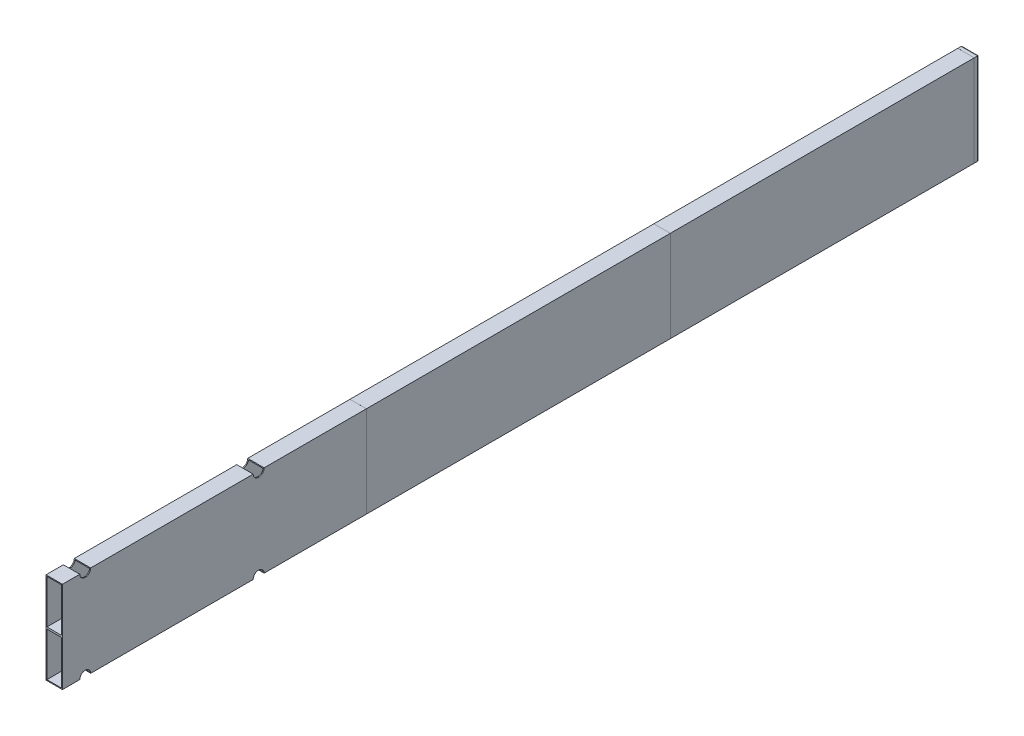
ISO-10303-21;
HEADER;
FILE_DESCRIPTION(('STEP AP214'),'2;1');
FILE_NAME('part.step','',(''),(''),'','','');
FILE_SCHEMA(('AUTOMOTIVE_DESIGN { 1 0 10303 214 1 1 1 1 }'));
ENDSEC;
DATA;
#1=APPLICATION_CONTEXT('core data for automotive mechanical design processes');
#2=APPLICATION_PROTOCOL_DEFINITION('international standard','automotive_design',2000,#1);
#3=PRODUCT_CONTEXT('',#1,'mechanical');
#4=PRODUCT('Part','Part','',(#3));
#5=PRODUCT_RELATED_PRODUCT_CATEGORY('part','',(#4));
#6=PRODUCT_DEFINITION_FORMATION('','',#4);
#7=PRODUCT_DEFINITION_CONTEXT('part definition',#1,'design');
#8=PRODUCT_DEFINITION('design','',#6,#7);
#9=PRODUCT_DEFINITION_SHAPE('','',#8);
#10=(LENGTH_UNIT() NAMED_UNIT(*) SI_UNIT(.MILLI.,.METRE.));
#11=(NAMED_UNIT(*) PLANE_ANGLE_UNIT() SI_UNIT($,.RADIAN.));
#12=(NAMED_UNIT(*) SI_UNIT($,.STERADIAN.) SOLID_ANGLE_UNIT());
#13=UNCERTAINTY_MEASURE_WITH_UNIT(LENGTH_MEASURE(1.E-05),#10,'distance_accuracy_value','');
#14=(GEOMETRIC_REPRESENTATION_CONTEXT(3) GLOBAL_UNCERTAINTY_ASSIGNED_CONTEXT((#13)) GLOBAL_UNIT_ASSIGNED_CONTEXT((#10,
#11,#12)) REPRESENTATION_CONTEXT('',''));
#15=CARTESIAN_POINT('',(0.,0.,0.));
#16=DIRECTION('',(0.,0.,1.));
#17=DIRECTION('',(1.,0.,0.));
#18=AXIS2_PLACEMENT_3D('',#15,#16,#17);
#19=CARTESIAN_POINT('',(9.01,-0.00999999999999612,-666.));
#20=DIRECTION('',(0.,0.,-1.));
#21=DIRECTION('',(-1.,0.,0.));
#22=AXIS2_PLACEMENT_3D('',#19,#20,#21);
#23=PLANE('',#22);
#24=DIRECTION('',(0.,-1.,0.));
#25=VECTOR('',#24,1.);
#26=CARTESIAN_POINT('',(9.01,100.01,-666.));
#27=LINE('',#26,#25);
#28=CARTESIAN_POINT('',(9.01,100.01,-666.));
#29=VERTEX_POINT('',#28);
#30=CARTESIAN_POINT('',(9.01,-0.00999999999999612,-666.));
#31=VERTEX_POINT('',#30);
#32=EDGE_CURVE('E406',#29,#31,#27,.T.);
#33=ORIENTED_EDGE('',*,*,#32,.T.);
#34=DIRECTION('',(-1.,0.,0.));
#35=VECTOR('',#34,1.);
#36=CARTESIAN_POINT('',(9.01,-0.00999999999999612,-666.));
#37=LINE('',#36,#35);
#38=CARTESIAN_POINT('',(-9.01,-0.00999999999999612,-666.));
#39=VERTEX_POINT('',#38);
#40=EDGE_CURVE('E409',#31,#39,#37,.T.);
#41=ORIENTED_EDGE('',*,*,#40,.T.);
#42=DIRECTION('',(0.,1.,0.));
#43=VECTOR('',#42,1.);
#44=CARTESIAN_POINT('',(-9.01,100.01,-666.));
#45=LINE('',#44,#43);
#46=CARTESIAN_POINT('',(-9.01,100.01,-666.));
#47=VERTEX_POINT('',#46);
#48=EDGE_CURVE('E411',#39,#47,#45,.T.);
#49=ORIENTED_EDGE('',*,*,#48,.T.);
#50=DIRECTION('',(1.,0.,0.));
#51=VECTOR('',#50,1.);
#52=CARTESIAN_POINT('',(9.01,100.01,-666.));
#53=LINE('',#52,#51);
#54=EDGE_CURVE('E413',#47,#29,#53,.T.);
#55=ORIENTED_EDGE('',*,*,#54,.T.);
#56=EDGE_LOOP('',(#33,#41,#49,#55));
#57=FACE_BOUND('',#56,.T.);
#58=DIRECTION('',(-1.,0.,0.));
#59=VECTOR('',#58,1.);
#60=CARTESIAN_POINT('',(9.,0.,-666.));
#61=LINE('',#60,#59);
#62=CARTESIAN_POINT('',(9.,0.,-666.));
#63=VERTEX_POINT('',#62);
#64=CARTESIAN_POINT('',(-9.,0.,-666.));
#65=VERTEX_POINT('',#64);
#66=EDGE_CURVE('E368',#63,#65,#61,.T.);
#67=ORIENTED_EDGE('',*,*,#66,.F.);
#68=DIRECTION('',(0.,-1.,0.));
#69=VECTOR('',#68,1.);
#70=CARTESIAN_POINT('',(9.,100.,-666.));
#71=LINE('',#70,#69);
#72=CARTESIAN_POINT('',(9.,100.,-666.));
#73=VERTEX_POINT('',#72);
#74=EDGE_CURVE('E365',#73,#63,#71,.T.);
#75=ORIENTED_EDGE('',*,*,#74,.F.);
#76=DIRECTION('',(1.,0.,0.));
#77=VECTOR('',#76,1.);
#78=CARTESIAN_POINT('',(9.,100.,-666.));
#79=LINE('',#78,#77);
#80=CARTESIAN_POINT('',(-9.,100.,-666.));
#81=VERTEX_POINT('',#80);
#82=EDGE_CURVE('E373',#81,#73,#79,.T.);
#83=ORIENTED_EDGE('',*,*,#82,.F.);
#84=DIRECTION('',(0.,1.,0.));
#85=VECTOR('',#84,1.);
#86=CARTESIAN_POINT('',(-9.,100.,-666.));
#87=LINE('',#86,#85);
#88=EDGE_CURVE('E370',#65,#81,#87,.T.);
#89=ORIENTED_EDGE('',*,*,#88,.F.);
#90=EDGE_LOOP('',(#67,#75,#83,#89));
#91=FACE_BOUND('',#90,.T.);
#92=ADVANCED_FACE('F36',(#57,#91),#23,.T.);
#93=CARTESIAN_POINT('',(-9.,0.,-333.));
#94=DIRECTION('',(0.,-1.,0.));
#95=DIRECTION('',(0.,0.,-1.));
#96=AXIS2_PLACEMENT_3D('',#93,#94,#95);
#97=PLANE('',#96);
#98=DIRECTION('',(1.,0.,0.));
#99=VECTOR('',#98,1.);
#100=CARTESIAN_POINT('',(-9.00000000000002,0.,-221.));
#101=LINE('',#100,#99);
#102=CARTESIAN_POINT('',(-9.00000000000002,0.,-221.));
#103=VERTEX_POINT('',#102);
#104=CARTESIAN_POINT('',(9.,0.,-221.));
#105=VERTEX_POINT('',#104);
#106=EDGE_CURVE('E443',#103,#105,#101,.T.);
#107=ORIENTED_EDGE('',*,*,#106,.F.);
#108=DIRECTION('',(0.,0.,1.));
#109=VECTOR('',#108,1.);
#110=CARTESIAN_POINT('',(-9.,0.,-333.));
#111=LINE('',#110,#109);
#112=CARTESIAN_POINT('',(-9.,0.,-333.));
#113=VERTEX_POINT('',#112);
#114=EDGE_CURVE('E593',#113,#103,#111,.T.);
#115=ORIENTED_EDGE('',*,*,#114,.F.);
#116=DIRECTION('',(1.,0.,0.));
#117=VECTOR('',#116,1.);
#118=CARTESIAN_POINT('',(-9.,0.,-333.));
#119=LINE('',#118,#117);
#120=CARTESIAN_POINT('',(9.,0.,-333.));
#121=VERTEX_POINT('',#120);
#122=EDGE_CURVE('E567',#113,#121,#119,.T.);
#123=ORIENTED_EDGE('',*,*,#122,.T.);
#124=DIRECTION('',(0.,0.,1.));
#125=VECTOR('',#124,1.);
#126=CARTESIAN_POINT('',(9.,0.,-333.));
#127=LINE('',#126,#125);
#128=EDGE_CURVE('E588',#121,#105,#127,.T.);
#129=ORIENTED_EDGE('',*,*,#128,.T.);
#130=EDGE_LOOP('',(#107,#115,#123,#129));
#131=FACE_BOUND('',#130,.T.);
#132=ADVANCED_FACE('F662',(#131),#97,.T.);
#133=CARTESIAN_POINT('',(-8.,1.,-333.));
#134=DIRECTION('',(0.,-1.,0.));
#135=DIRECTION('',(0.,0.,-1.));
#136=AXIS2_PLACEMENT_3D('',#133,#134,#135);
#137=PLANE('',#136);
#138=DIRECTION('',(0.,0.,1.));
#139=VECTOR('',#138,1.);
#140=CARTESIAN_POINT('',(-8.,1.,-333.));
#141=LINE('',#140,#139);
#142=CARTESIAN_POINT('',(-8.,1.,-999.));
#143=VERTEX_POINT('',#142);
#144=CARTESIAN_POINT('',(-8.,1.,-220.9160797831));
#145=VERTEX_POINT('',#144);
#146=EDGE_CURVE('E522',#143,#145,#141,.T.);
#147=ORIENTED_EDGE('',*,*,#146,.T.);
#148=DIRECTION('',(1.,0.,0.));
#149=VECTOR('',#148,1.);
#150=CARTESIAN_POINT('',(-9.00000000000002,1.,-220.9160797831));
#151=LINE('',#150,#149);
#152=CARTESIAN_POINT('',(8.,1.,-220.9160797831));
#153=VERTEX_POINT('',#152);
#154=EDGE_CURVE('E435',#145,#153,#151,.T.);
#155=ORIENTED_EDGE('',*,*,#154,.T.);
#156=DIRECTION('',(0.,0.,1.));
#157=VECTOR('',#156,1.);
#158=CARTESIAN_POINT('',(8.,1.,-333.));
#159=LINE('',#158,#157);
#160=CARTESIAN_POINT('',(8.,1.,-999.));
#161=VERTEX_POINT('',#160);
#162=EDGE_CURVE('E517',#161,#153,#159,.T.);
#163=ORIENTED_EDGE('',*,*,#162,.F.);
#164=DIRECTION('',(-1.,0.,0.));
#165=VECTOR('',#164,1.);
#166=CARTESIAN_POINT('',(8.,1.,-999.));
#167=LINE('',#166,#165);
#168=EDGE_CURVE('E344',#161,#143,#167,.T.);
#169=ORIENTED_EDGE('',*,*,#168,.T.);
#170=EDGE_LOOP('',(#147,#155,#163,#169));
#171=FACE_BOUND('',#170,.T.);
#172=ADVANCED_FACE('F668',(#171),#137,.F.);
#173=DIRECTION('',(1.,0.,0.));
#174=VECTOR('',#173,1.);
#175=CARTESIAN_POINT('',(-9.00000000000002,0.,-209.));
#176=LINE('',#175,#174);
#177=CARTESIAN_POINT('',(9.,0.,-209.));
#178=VERTEX_POINT('',#177);
#179=CARTESIAN_POINT('',(-9.00000000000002,0.,-209.));
#180=VERTEX_POINT('',#179);
#181=EDGE_CURVE('E441',#178,#180,#176,.F.);
#182=ORIENTED_EDGE('',*,*,#181,.F.);
#183=CARTESIAN_POINT('',(9.,0.,-31.));
#184=VERTEX_POINT('',#183);
#185=EDGE_CURVE('E591',#178,#184,#127,.T.);
#186=ORIENTED_EDGE('',*,*,#185,.T.);
#187=DIRECTION('',(1.,0.,0.));
#188=VECTOR('',#187,1.);
#189=CARTESIAN_POINT('',(-9.00000000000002,0.,-31.));
#190=LINE('',#189,#188);
#191=CARTESIAN_POINT('',(-9.00000000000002,0.,-31.));
#192=VERTEX_POINT('',#191);
#193=EDGE_CURVE('E458',#192,#184,#190,.T.);
#194=ORIENTED_EDGE('',*,*,#193,.F.);
#195=EDGE_CURVE('E596',#180,#192,#111,.T.);
#196=ORIENTED_EDGE('',*,*,#195,.F.);
#197=EDGE_LOOP('',(#182,#186,#194,#196));
#198=FACE_BOUND('',#197,.T.);
#199=ADVANCED_FACE('F670',(#198),#97,.T.);
#200=CARTESIAN_POINT('',(8.,1.,-209.0839202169));
#201=VERTEX_POINT('',#200);
#202=CARTESIAN_POINT('',(8.,1.,-30.9160797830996));
#203=VERTEX_POINT('',#202);
#204=EDGE_CURVE('E520',#201,#203,#159,.T.);
#205=ORIENTED_EDGE('',*,*,#204,.F.);
#206=DIRECTION('',(1.,0.,0.));
#207=VECTOR('',#206,1.);
#208=CARTESIAN_POINT('',(-9.00000000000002,1.,-209.0839202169));
#209=LINE('',#208,#207);
#210=CARTESIAN_POINT('',(-8.,1.,-209.0839202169));
#211=VERTEX_POINT('',#210);
#212=EDGE_CURVE('E432',#201,#211,#209,.F.);
#213=ORIENTED_EDGE('',*,*,#212,.T.);
#214=CARTESIAN_POINT('',(-8.,1.,-30.9160797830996));
#215=VERTEX_POINT('',#214);
#216=EDGE_CURVE('E525',#211,#215,#141,.T.);
#217=ORIENTED_EDGE('',*,*,#216,.T.);
#218=DIRECTION('',(1.,0.,0.));
#219=VECTOR('',#218,1.);
#220=CARTESIAN_POINT('',(-9.00000000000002,1.,-30.9160797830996));
#221=LINE('',#220,#219);
#222=EDGE_CURVE('E605',#215,#203,#221,.T.);
#223=ORIENTED_EDGE('',*,*,#222,.T.);
#224=EDGE_LOOP('',(#205,#213,#217,#223));
#225=FACE_BOUND('',#224,.T.);
#226=ADVANCED_FACE('F723',(#225),#137,.F.);
#227=CARTESIAN_POINT('',(-9.00000000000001,100.,-333.));
#228=DIRECTION('',(0.,1.,0.));
#229=DIRECTION('',(0.,0.,1.));
#230=AXIS2_PLACEMENT_3D('',#227,#228,#229);
#231=PLANE('',#230);
#232=DIRECTION('',(1.,0.,0.));
#233=VECTOR('',#232,1.);
#234=CARTESIAN_POINT('',(-9.00000000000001,100.,-209.));
#235=LINE('',#234,#233);
#236=CARTESIAN_POINT('',(-9.00000000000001,100.,-209.));
#237=VERTEX_POINT('',#236);
#238=CARTESIAN_POINT('',(9.00000000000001,100.,-209.));
#239=VERTEX_POINT('',#238);
#240=EDGE_CURVE('E477',#237,#239,#235,.T.);
#241=ORIENTED_EDGE('',*,*,#240,.F.);
#242=DIRECTION('',(0.,0.,1.));
#243=VECTOR('',#242,1.);
#244=CARTESIAN_POINT('',(-9.00000000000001,100.,-333.));
#245=LINE('',#244,#243);
#246=CARTESIAN_POINT('',(-9.00000000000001,100.,-31.));
#247=VERTEX_POINT('',#246);
#248=EDGE_CURVE('E581',#237,#247,#245,.T.);
#249=ORIENTED_EDGE('',*,*,#248,.T.);
#250=DIRECTION('',(1.,0.,0.));
#251=VECTOR('',#250,1.);
#252=CARTESIAN_POINT('',(-9.00000000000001,100.,-31.));
#253=LINE('',#252,#251);
#254=CARTESIAN_POINT('',(9.00000000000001,100.,-31.));
#255=VERTEX_POINT('',#254);
#256=EDGE_CURVE('E494',#255,#247,#253,.F.);
#257=ORIENTED_EDGE('',*,*,#256,.F.);
#258=DIRECTION('',(0.,0.,1.));
#259=VECTOR('',#258,1.);
#260=CARTESIAN_POINT('',(9.00000000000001,100.,-333.));
#261=LINE('',#260,#259);
#262=EDGE_CURVE('E586',#239,#255,#261,.T.);
#263=ORIENTED_EDGE('',*,*,#262,.F.);
#264=EDGE_LOOP('',(#241,#249,#257,#263));
#265=FACE_BOUND('',#264,.T.);
#266=ADVANCED_FACE('F754',(#265),#231,.T.);
#267=CARTESIAN_POINT('',(-8.,99.,-333.));
#268=DIRECTION('',(0.,1.,0.));
#269=DIRECTION('',(0.,0.,1.));
#270=AXIS2_PLACEMENT_3D('',#267,#268,#269);
#271=PLANE('',#270);
#272=DIRECTION('',(0.,0.,1.));
#273=VECTOR('',#272,1.);
#274=CARTESIAN_POINT('',(-8.,99.,-333.));
#275=LINE('',#274,#273);
#276=CARTESIAN_POINT('',(-8.,99.,-209.0839202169));
#277=VERTEX_POINT('',#276);
#278=CARTESIAN_POINT('',(-8.,99.,-30.9160797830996));
#279=VERTEX_POINT('',#278);
#280=EDGE_CURVE('E541',#277,#279,#275,.T.);
#281=ORIENTED_EDGE('',*,*,#280,.F.);
#282=DIRECTION('',(1.,0.,0.));
#283=VECTOR('',#282,1.);
#284=CARTESIAN_POINT('',(-9.00000000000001,99.,-209.0839202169));
#285=LINE('',#284,#283);
#286=CARTESIAN_POINT('',(8.,99.,-209.0839202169));
#287=VERTEX_POINT('',#286);
#288=EDGE_CURVE('E469',#277,#287,#285,.T.);
#289=ORIENTED_EDGE('',*,*,#288,.T.);
#290=DIRECTION('',(0.,0.,1.));
#291=VECTOR('',#290,1.);
#292=CARTESIAN_POINT('',(8.,99.,-333.));
#293=LINE('',#292,#291);
#294=CARTESIAN_POINT('',(8.,99.,-30.9160797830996));
#295=VERTEX_POINT('',#294);
#296=EDGE_CURVE('E546',#287,#295,#293,.T.);
#297=ORIENTED_EDGE('',*,*,#296,.T.);
#298=DIRECTION('',(1.,0.,0.));
#299=VECTOR('',#298,1.);
#300=CARTESIAN_POINT('',(-9.00000000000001,99.,-30.9160797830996));
#301=LINE('',#300,#299);
#302=EDGE_CURVE('E485',#295,#279,#301,.F.);
#303=ORIENTED_EDGE('',*,*,#302,.T.);
#304=EDGE_LOOP('',(#281,#289,#297,#303));
#305=FACE_BOUND('',#304,.T.);
#306=ADVANCED_FACE('F734',(#305),#271,.F.);
#307=DIRECTION('',(1.,0.,0.));
#308=VECTOR('',#307,1.);
#309=CARTESIAN_POINT('',(-9.00000000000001,100.,-19.));
#310=LINE('',#309,#308);
#311=CARTESIAN_POINT('',(-9.00000000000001,100.,-19.));
#312=VERTEX_POINT('',#311);
#313=CARTESIAN_POINT('',(9.00000000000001,100.,-19.));
#314=VERTEX_POINT('',#313);
#315=EDGE_CURVE('E497',#312,#314,#310,.T.);
#316=ORIENTED_EDGE('',*,*,#315,.F.);
#317=CARTESIAN_POINT('',(-9.00000000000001,100.,0.));
#318=VERTEX_POINT('',#317);
#319=EDGE_CURVE('E582',#312,#318,#245,.T.);
#320=ORIENTED_EDGE('',*,*,#319,.T.);
#321=DIRECTION('',(-1.,0.,0.));
#322=VECTOR('',#321,1.);
#323=CARTESIAN_POINT('',(-9.00000000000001,100.,0.));
#324=LINE('',#323,#322);
#325=CARTESIAN_POINT('',(9.00000000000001,100.,0.));
#326=VERTEX_POINT('',#325);
#327=EDGE_CURVE('E561',#326,#318,#324,.T.);
#328=ORIENTED_EDGE('',*,*,#327,.F.);
#329=EDGE_CURVE('E587',#314,#326,#261,.T.);
#330=ORIENTED_EDGE('',*,*,#329,.F.);
#331=EDGE_LOOP('',(#316,#320,#328,#330));
#332=FACE_BOUND('',#331,.T.);
#333=ADVANCED_FACE('F755',(#332),#231,.T.);
#334=CARTESIAN_POINT('',(-8.,99.,-19.0839202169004));
#335=VERTEX_POINT('',#334);
#336=CARTESIAN_POINT('',(-8.,99.,0.));
#337=VERTEX_POINT('',#336);
#338=EDGE_CURVE('E542',#335,#337,#275,.T.);
#339=ORIENTED_EDGE('',*,*,#338,.F.);
#340=DIRECTION('',(1.,0.,0.));
#341=VECTOR('',#340,1.);
#342=CARTESIAN_POINT('',(-9.00000000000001,99.,-19.0839202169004));
#343=LINE('',#342,#341);
#344=CARTESIAN_POINT('',(8.,99.,-19.0839202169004));
#345=VERTEX_POINT('',#344);
#346=EDGE_CURVE('E488',#335,#345,#343,.T.);
#347=ORIENTED_EDGE('',*,*,#346,.T.);
#348=CARTESIAN_POINT('',(8.,99.,0.));
#349=VERTEX_POINT('',#348);
#350=EDGE_CURVE('E547',#345,#349,#293,.T.);
#351=ORIENTED_EDGE('',*,*,#350,.T.);
#352=DIRECTION('',(-1.,0.,0.));
#353=VECTOR('',#352,1.);
#354=CARTESIAN_POINT('',(-8.,99.,0.));
#355=LINE('',#354,#353);
#356=EDGE_CURVE('E533',#349,#337,#355,.T.);
#357=ORIENTED_EDGE('',*,*,#356,.T.);
#358=EDGE_LOOP('',(#339,#347,#351,#357));
#359=FACE_BOUND('',#358,.T.);
#360=ADVANCED_FACE('F735',(#359),#271,.F.);
#361=CARTESIAN_POINT('',(-9.00000000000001,100.,-333.));
#362=DIRECTION('',(-1.,0.,0.));
#363=DIRECTION('',(0.,-1.,0.));
#364=AXIS2_PLACEMENT_3D('',#361,#362,#363);
#365=PLANE('',#364);
#366=CARTESIAN_POINT('',(-9.00000000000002,0.,-215.));
#367=DIRECTION('',(1.,0.,0.));
#368=DIRECTION('',(0.,1.,0.));
#369=AXIS2_PLACEMENT_3D('',#366,#367,#368);
#370=CIRCLE('',#369,6.00000000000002);
#371=EDGE_CURVE('E429',#103,#180,#370,.T.);
#372=ORIENTED_EDGE('',*,*,#371,.T.);
#373=ORIENTED_EDGE('',*,*,#195,.T.);
#374=CARTESIAN_POINT('',(-9.00000000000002,0.,-25.));
#375=DIRECTION('',(1.,0.,0.));
#376=DIRECTION('',(0.,1.,0.));
#377=AXIS2_PLACEMENT_3D('',#374,#375,#376);
#378=CIRCLE('',#377,6.);
#379=CARTESIAN_POINT('',(-9.00000000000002,0.,-19.));
#380=VERTEX_POINT('',#379);
#381=EDGE_CURVE('E447',#192,#380,#378,.T.);
#382=ORIENTED_EDGE('',*,*,#381,.T.);
#383=CARTESIAN_POINT('',(-9.,0.,0.));
#384=VERTEX_POINT('',#383);
#385=EDGE_CURVE('E576',#380,#384,#111,.T.);
#386=ORIENTED_EDGE('',*,*,#385,.T.);
#387=DIRECTION('',(0.,-1.,0.));
#388=VECTOR('',#387,1.);
#389=CARTESIAN_POINT('',(-9.00000000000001,100.,0.));
#390=LINE('',#389,#388);
#391=EDGE_CURVE('E540',#318,#384,#390,.T.);
#392=ORIENTED_EDGE('',*,*,#391,.F.);
#393=ORIENTED_EDGE('',*,*,#319,.F.);
#394=CARTESIAN_POINT('',(-9.00000000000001,100.,-25.));
#395=DIRECTION('',(1.,0.,0.));
#396=DIRECTION('',(0.,1.,0.));
#397=AXIS2_PLACEMENT_3D('',#394,#395,#396);
#398=CIRCLE('',#397,6.00000000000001);
#399=EDGE_CURVE('E482',#312,#247,#398,.T.);
#400=ORIENTED_EDGE('',*,*,#399,.T.);
#401=ORIENTED_EDGE('',*,*,#248,.F.);
#402=CARTESIAN_POINT('',(-9.00000000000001,100.,-215.));
#403=DIRECTION('',(1.,0.,0.));
#404=DIRECTION('',(0.,1.,0.));
#405=AXIS2_PLACEMENT_3D('',#402,#403,#404);
#406=CIRCLE('',#405,6.00000000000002);
#407=CARTESIAN_POINT('',(-9.00000000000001,100.,-221.));
#408=VERTEX_POINT('',#407);
#409=EDGE_CURVE('E463',#237,#408,#406,.T.);
#410=ORIENTED_EDGE('',*,*,#409,.T.);
#411=CARTESIAN_POINT('',(-9.00000000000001,100.,-333.));
#412=VERTEX_POINT('',#411);
#413=EDGE_CURVE('E577',#412,#408,#245,.T.);
#414=ORIENTED_EDGE('',*,*,#413,.F.);
#415=DIRECTION('',(0.,-1.,0.));
#416=VECTOR('',#415,1.);
#417=CARTESIAN_POINT('',(-9.00000000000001,100.,-333.));
#418=LINE('',#417,#416);
#419=EDGE_CURVE('E564',#412,#113,#418,.T.);
#420=ORIENTED_EDGE('',*,*,#419,.T.);
#421=ORIENTED_EDGE('',*,*,#114,.T.);
#422=EDGE_LOOP('',(#372,#373,#382,#386,#392,#393,#400,#401,#410,#414,#420,#421));
#423=FACE_BOUND('',#422,.T.);
#424=ADVANCED_FACE('F38',(#423),#365,.T.);
#425=DIRECTION('',(1.,0.,0.));
#426=VECTOR('',#425,1.);
#427=CARTESIAN_POINT('',(-9.00000000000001,100.,-221.));
#428=LINE('',#427,#426);
#429=CARTESIAN_POINT('',(9.00000000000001,100.,-221.));
#430=VERTEX_POINT('',#429);
#431=EDGE_CURVE('E475',#430,#408,#428,.F.);
#432=ORIENTED_EDGE('',*,*,#431,.F.);
#433=CARTESIAN_POINT('',(9.00000000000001,100.,-333.));
#434=VERTEX_POINT('',#433);
#435=EDGE_CURVE('E583',#434,#430,#261,.T.);
#436=ORIENTED_EDGE('',*,*,#435,.F.);
#437=DIRECTION('',(-1.,0.,0.));
#438=VECTOR('',#437,1.);
#439=CARTESIAN_POINT('',(-9.00000000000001,100.,-333.));
#440=LINE('',#439,#438);
#441=EDGE_CURVE('E573',#434,#412,#440,.T.);
#442=ORIENTED_EDGE('',*,*,#441,.T.);
#443=ORIENTED_EDGE('',*,*,#413,.T.);
#444=EDGE_LOOP('',(#432,#436,#442,#443));
#445=FACE_BOUND('',#444,.T.);
#446=ADVANCED_FACE('F749',(#445),#231,.T.);
#447=CARTESIAN_POINT('',(9.00000000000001,100.,-333.));
#448=DIRECTION('',(1.,0.,0.));
#449=DIRECTION('',(0.,1.,0.));
#450=AXIS2_PLACEMENT_3D('',#447,#448,#449);
#451=PLANE('',#450);
#452=CARTESIAN_POINT('',(9.,0.,-215.));
#453=DIRECTION('',(1.,0.,0.));
#454=DIRECTION('',(0.,1.,0.));
#455=AXIS2_PLACEMENT_3D('',#452,#453,#454);
#456=CIRCLE('',#455,6.00000000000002);
#457=EDGE_CURVE('E427',#105,#178,#456,.T.);
#458=ORIENTED_EDGE('',*,*,#457,.F.);
#459=ORIENTED_EDGE('',*,*,#128,.F.);
#460=DIRECTION('',(0.,1.,0.));
#461=VECTOR('',#460,1.);
#462=CARTESIAN_POINT('',(9.00000000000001,100.,-333.));
#463=LINE('',#462,#461);
#464=EDGE_CURVE('E570',#121,#434,#463,.T.);
#465=ORIENTED_EDGE('',*,*,#464,.T.);
#466=ORIENTED_EDGE('',*,*,#435,.T.);
#467=CARTESIAN_POINT('',(9.00000000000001,100.,-215.));
#468=DIRECTION('',(1.,0.,0.));
#469=DIRECTION('',(0.,1.,0.));
#470=AXIS2_PLACEMENT_3D('',#467,#468,#469);
#471=CIRCLE('',#470,6.00000000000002);
#472=EDGE_CURVE('E461',#239,#430,#471,.T.);
#473=ORIENTED_EDGE('',*,*,#472,.F.);
#474=ORIENTED_EDGE('',*,*,#262,.T.);
#475=CARTESIAN_POINT('',(9.00000000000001,100.,-25.));
#476=DIRECTION('',(1.,0.,0.));
#477=DIRECTION('',(0.,1.,0.));
#478=AXIS2_PLACEMENT_3D('',#475,#476,#477);
#479=CIRCLE('',#478,6.00000000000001);
#480=EDGE_CURVE('E479',#314,#255,#479,.T.);
#481=ORIENTED_EDGE('',*,*,#480,.F.);
#482=ORIENTED_EDGE('',*,*,#329,.T.);
#483=DIRECTION('',(0.,1.,0.));
#484=VECTOR('',#483,1.);
#485=CARTESIAN_POINT('',(9.00000000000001,100.,0.));
#486=LINE('',#485,#484);
#487=CARTESIAN_POINT('',(9.,0.,0.));
#488=VERTEX_POINT('',#487);
#489=EDGE_CURVE('E558',#488,#326,#486,.T.);
#490=ORIENTED_EDGE('',*,*,#489,.F.);
#491=CARTESIAN_POINT('',(9.,0.,-19.));
#492=VERTEX_POINT('',#491);
#493=EDGE_CURVE('E592',#492,#488,#127,.T.);
#494=ORIENTED_EDGE('',*,*,#493,.F.);
#495=CARTESIAN_POINT('',(9.,0.,-25.));
#496=DIRECTION('',(1.,0.,0.));
#497=DIRECTION('',(0.,1.,0.));
#498=AXIS2_PLACEMENT_3D('',#495,#496,#497);
#499=CIRCLE('',#498,6.);
#500=EDGE_CURVE('E445',#184,#492,#499,.T.);
#501=ORIENTED_EDGE('',*,*,#500,.F.);
#502=ORIENTED_EDGE('',*,*,#185,.F.);
#503=EDGE_LOOP('',(#458,#459,#465,#466,#473,#474,#481,#482,#490,#494,#501,#502));
#504=FACE_BOUND('',#503,.T.);
#505=ADVANCED_FACE('F752',(#504),#451,.T.);
#506=DIRECTION('',(1.,0.,0.));
#507=VECTOR('',#506,1.);
#508=CARTESIAN_POINT('',(-9.00000000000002,0.,-19.));
#509=LINE('',#508,#507);
#510=EDGE_CURVE('E456',#492,#380,#509,.F.);
#511=ORIENTED_EDGE('',*,*,#510,.F.);
#512=ORIENTED_EDGE('',*,*,#493,.T.);
#513=DIRECTION('',(1.,0.,0.));
#514=VECTOR('',#513,1.);
#515=CARTESIAN_POINT('',(-9.,0.,0.));
#516=LINE('',#515,#514);
#517=EDGE_CURVE('E555',#384,#488,#516,.T.);
#518=ORIENTED_EDGE('',*,*,#517,.F.);
#519=ORIENTED_EDGE('',*,*,#385,.F.);
#520=EDGE_LOOP('',(#511,#512,#518,#519));
#521=FACE_BOUND('',#520,.T.);
#522=ADVANCED_FACE('F671',(#521),#97,.T.);
#523=CARTESIAN_POINT('',(-9.,0.,0.));
#524=DIRECTION('',(0.,0.,1.));
#525=DIRECTION('',(1.,0.,0.));
#526=AXIS2_PLACEMENT_3D('',#523,#524,#525);
#527=PLANE('',#526);
#528=DIRECTION('',(0.,-1.,0.));
#529=VECTOR('',#528,1.);
#530=CARTESIAN_POINT('',(-8.,1.,0.));
#531=LINE('',#530,#529);
#532=CARTESIAN_POINT('',(-8.00000000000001,49.,0.));
#533=VERTEX_POINT('',#532);
#534=CARTESIAN_POINT('',(-8.,1.,0.));
#535=VERTEX_POINT('',#534);
#536=EDGE_CURVE('E499',#533,#535,#531,.T.);
#537=ORIENTED_EDGE('',*,*,#536,.F.);
#538=DIRECTION('',(-1.,0.,0.));
#539=VECTOR('',#538,1.);
#540=CARTESIAN_POINT('',(-8.00000000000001,49.,0.));
#541=LINE('',#540,#539);
#542=CARTESIAN_POINT('',(8.00000000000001,49.,0.));
#543=VERTEX_POINT('',#542);
#544=EDGE_CURVE('E508',#543,#533,#541,.T.);
#545=ORIENTED_EDGE('',*,*,#544,.F.);
#546=DIRECTION('',(0.,1.,0.));
#547=VECTOR('',#546,1.);
#548=CARTESIAN_POINT('',(8.,1.,0.));
#549=LINE('',#548,#547);
#550=CARTESIAN_POINT('',(8.,1.,0.));
#551=VERTEX_POINT('',#550);
#552=EDGE_CURVE('E505',#551,#543,#549,.T.);
#553=ORIENTED_EDGE('',*,*,#552,.F.);
#554=DIRECTION('',(1.,0.,0.));
#555=VECTOR('',#554,1.);
#556=CARTESIAN_POINT('',(-8.,1.,0.));
#557=LINE('',#556,#555);
#558=EDGE_CURVE('E502',#535,#551,#557,.T.);
#559=ORIENTED_EDGE('',*,*,#558,.F.);
#560=EDGE_LOOP('',(#537,#545,#553,#559));
#561=FACE_BOUND('',#560,.T.);
#562=DIRECTION('',(0.,-1.,0.));
#563=VECTOR('',#562,1.);
#564=CARTESIAN_POINT('',(-8.,99.,0.));
#565=LINE('',#564,#563);
#566=CARTESIAN_POINT('',(-8.00000000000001,51.,0.));
#567=VERTEX_POINT('',#566);
#568=EDGE_CURVE('E514',#337,#567,#565,.T.);
#569=ORIENTED_EDGE('',*,*,#568,.F.);
#570=ORIENTED_EDGE('',*,*,#356,.F.);
#571=DIRECTION('',(0.,1.,0.));
#572=VECTOR('',#571,1.);
#573=CARTESIAN_POINT('',(8.,99.,0.));
#574=LINE('',#573,#572);
#575=CARTESIAN_POINT('',(8.00000000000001,51.,0.));
#576=VERTEX_POINT('',#575);
#577=EDGE_CURVE('E530',#576,#349,#574,.T.);
#578=ORIENTED_EDGE('',*,*,#577,.F.);
#579=DIRECTION('',(1.,0.,0.));
#580=VECTOR('',#579,1.);
#581=CARTESIAN_POINT('',(-8.00000000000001,51.,0.));
#582=LINE('',#581,#580);
#583=EDGE_CURVE('E527',#567,#576,#582,.T.);
#584=ORIENTED_EDGE('',*,*,#583,.F.);
#585=EDGE_LOOP('',(#569,#570,#578,#584));
#586=FACE_BOUND('',#585,.T.);
#587=ORIENTED_EDGE('',*,*,#391,.T.);
#588=ORIENTED_EDGE('',*,*,#517,.T.);
#589=ORIENTED_EDGE('',*,*,#489,.T.);
#590=ORIENTED_EDGE('',*,*,#327,.T.);
#591=EDGE_LOOP('',(#587,#588,#589,#590));
#592=FACE_BOUND('',#591,.T.);
#593=ADVANCED_FACE('F744',(#561,#586,#592),#527,.T.);
#594=CARTESIAN_POINT('',(-8.,99.,-333.));
#595=DIRECTION('',(-1.,0.,0.));
#596=DIRECTION('',(0.,-1.,0.));
#597=AXIS2_PLACEMENT_3D('',#594,#595,#596);
#598=PLANE('',#597);
#599=CARTESIAN_POINT('',(-8.,99.,-999.));
#600=VERTEX_POINT('',#599);
#601=CARTESIAN_POINT('',(-8.,99.,-220.9160797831));
#602=VERTEX_POINT('',#601);
#603=EDGE_CURVE('E537',#600,#602,#275,.T.);
#604=ORIENTED_EDGE('',*,*,#603,.T.);
#605=CARTESIAN_POINT('',(-8.,100.,-215.));
#606=DIRECTION('',(-1.,0.,0.));
#607=DIRECTION('',(0.,-1.,0.));
#608=AXIS2_PLACEMENT_3D('',#605,#606,#607);
#609=CIRCLE('',#608,6.00000000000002);
#610=EDGE_CURVE('E472',#602,#277,#609,.T.);
#611=ORIENTED_EDGE('',*,*,#610,.T.);
#612=ORIENTED_EDGE('',*,*,#280,.T.);
#613=CARTESIAN_POINT('',(-8.,100.,-25.));
#614=DIRECTION('',(-1.,0.,0.));
#615=DIRECTION('',(0.,-1.,0.));
#616=AXIS2_PLACEMENT_3D('',#613,#614,#615);
#617=CIRCLE('',#616,6.00000000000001);
#618=EDGE_CURVE('E491',#279,#335,#617,.T.);
#619=ORIENTED_EDGE('',*,*,#618,.T.);
#620=ORIENTED_EDGE('',*,*,#338,.T.);
#621=ORIENTED_EDGE('',*,*,#568,.T.);
#622=DIRECTION('',(0.,0.,1.));
#623=VECTOR('',#622,1.);
#624=CARTESIAN_POINT('',(-8.00000000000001,51.,-333.));
#625=LINE('',#624,#623);
#626=CARTESIAN_POINT('',(-8.,51.,-999.));
#627=VERTEX_POINT('',#626);
#628=EDGE_CURVE('E536',#627,#567,#625,.T.);
#629=ORIENTED_EDGE('',*,*,#628,.F.);
#630=DIRECTION('',(0.,1.,0.));
#631=VECTOR('',#630,1.);
#632=CARTESIAN_POINT('',(-8.,51.,-999.));
#633=LINE('',#632,#631);
#634=EDGE_CURVE('E359',#627,#600,#633,.T.);
#635=ORIENTED_EDGE('',*,*,#634,.T.);
#636=EDGE_LOOP('',(#604,#611,#612,#619,#620,#621,#629,#635));
#637=FACE_BOUND('',#636,.T.);
#638=ADVANCED_FACE('F732',(#637),#598,.F.);
#639=CARTESIAN_POINT('',(8.,99.,-999.));
#640=VERTEX_POINT('',#639);
#641=CARTESIAN_POINT('',(8.,99.,-220.9160797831));
#642=VERTEX_POINT('',#641);
#643=EDGE_CURVE('E543',#640,#642,#293,.T.);
#644=ORIENTED_EDGE('',*,*,#643,.T.);
#645=DIRECTION('',(1.,0.,0.));
#646=VECTOR('',#645,1.);
#647=CARTESIAN_POINT('',(-9.00000000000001,99.,-220.9160797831));
#648=LINE('',#647,#646);
#649=EDGE_CURVE('E466',#642,#602,#648,.F.);
#650=ORIENTED_EDGE('',*,*,#649,.T.);
#651=ORIENTED_EDGE('',*,*,#603,.F.);
#652=DIRECTION('',(1.,0.,0.));
#653=VECTOR('',#652,1.);
#654=CARTESIAN_POINT('',(8.,99.,-999.));
#655=LINE('',#654,#653);
#656=EDGE_CURVE('E362',#600,#640,#655,.T.);
#657=ORIENTED_EDGE('',*,*,#656,.T.);
#658=EDGE_LOOP('',(#644,#650,#651,#657));
#659=FACE_BOUND('',#658,.T.);
#660=ADVANCED_FACE('F728',(#659),#271,.F.);
#661=CARTESIAN_POINT('',(8.,99.,-333.));
#662=DIRECTION('',(1.,0.,0.));
#663=DIRECTION('',(0.,1.,0.));
#664=AXIS2_PLACEMENT_3D('',#661,#662,#663);
#665=PLANE('',#664);
#666=ORIENTED_EDGE('',*,*,#296,.F.);
#667=CARTESIAN_POINT('',(8.,100.,-215.));
#668=DIRECTION('',(1.,0.,0.));
#669=DIRECTION('',(0.,1.,0.));
#670=AXIS2_PLACEMENT_3D('',#667,#668,#669);
#671=CIRCLE('',#670,6.00000000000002);
#672=EDGE_CURVE('E599',#287,#642,#671,.T.);
#673=ORIENTED_EDGE('',*,*,#672,.T.);
#674=ORIENTED_EDGE('',*,*,#643,.F.);
#675=DIRECTION('',(0.,-1.,0.));
#676=VECTOR('',#675,1.);
#677=CARTESIAN_POINT('',(8.,51.,-999.));
#678=LINE('',#677,#676);
#679=CARTESIAN_POINT('',(8.,51.,-999.));
#680=VERTEX_POINT('',#679);
#681=EDGE_CURVE('E353',#640,#680,#678,.T.);
#682=ORIENTED_EDGE('',*,*,#681,.T.);
#683=DIRECTION('',(0.,0.,1.));
#684=VECTOR('',#683,1.);
#685=CARTESIAN_POINT('',(8.00000000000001,51.,-333.));
#686=LINE('',#685,#684);
#687=EDGE_CURVE('E548',#680,#576,#686,.T.);
#688=ORIENTED_EDGE('',*,*,#687,.T.);
#689=ORIENTED_EDGE('',*,*,#577,.T.);
#690=ORIENTED_EDGE('',*,*,#350,.F.);
#691=CARTESIAN_POINT('',(8.,100.,-25.));
#692=DIRECTION('',(1.,0.,0.));
#693=DIRECTION('',(0.,1.,0.));
#694=AXIS2_PLACEMENT_3D('',#691,#692,#693);
#695=CIRCLE('',#694,6.00000000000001);
#696=EDGE_CURVE('E580',#345,#295,#695,.T.);
#697=ORIENTED_EDGE('',*,*,#696,.T.);
#698=EDGE_LOOP('',(#666,#673,#674,#682,#688,#689,#690,#697));
#699=FACE_BOUND('',#698,.T.);
#700=ADVANCED_FACE('F731',(#699),#665,.F.);
#701=CARTESIAN_POINT('',(-8.00000000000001,51.,-333.));
#702=DIRECTION('',(0.,-1.,0.));
#703=DIRECTION('',(0.,0.,-1.));
#704=AXIS2_PLACEMENT_3D('',#701,#702,#703);
#705=PLANE('',#704);
#706=ORIENTED_EDGE('',*,*,#583,.T.);
#707=ORIENTED_EDGE('',*,*,#687,.F.);
#708=DIRECTION('',(-1.,0.,0.));
#709=VECTOR('',#708,1.);
#710=CARTESIAN_POINT('',(8.,51.,-999.));
#711=LINE('',#710,#709);
#712=EDGE_CURVE('E356',#680,#627,#711,.T.);
#713=ORIENTED_EDGE('',*,*,#712,.T.);
#714=ORIENTED_EDGE('',*,*,#628,.T.);
#715=EDGE_LOOP('',(#706,#707,#713,#714));
#716=FACE_BOUND('',#715,.T.);
#717=ADVANCED_FACE('F726',(#716),#705,.F.);
#718=CARTESIAN_POINT('',(-8.,1.,-333.));
#719=DIRECTION('',(-1.,0.,0.));
#720=DIRECTION('',(0.,-1.,0.));
#721=AXIS2_PLACEMENT_3D('',#718,#719,#720);
#722=PLANE('',#721);
#723=ORIENTED_EDGE('',*,*,#216,.F.);
#724=CARTESIAN_POINT('',(-8.,0.,-215.));
#725=DIRECTION('',(-1.,0.,0.));
#726=DIRECTION('',(0.,-1.,0.));
#727=AXIS2_PLACEMENT_3D('',#724,#725,#726);
#728=CIRCLE('',#727,6.00000000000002);
#729=EDGE_CURVE('E438',#211,#145,#728,.T.);
#730=ORIENTED_EDGE('',*,*,#729,.T.);
#731=ORIENTED_EDGE('',*,*,#146,.F.);
#732=DIRECTION('',(0.,1.,0.));
#733=VECTOR('',#732,1.);
#734=CARTESIAN_POINT('',(-8.,49.,-999.));
#735=LINE('',#734,#733);
#736=CARTESIAN_POINT('',(-8.00000000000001,49.,-999.));
#737=VERTEX_POINT('',#736);
#738=EDGE_CURVE('E347',#143,#737,#735,.T.);
#739=ORIENTED_EDGE('',*,*,#738,.T.);
#740=DIRECTION('',(0.,0.,1.));
#741=VECTOR('',#740,1.);
#742=CARTESIAN_POINT('',(-8.00000000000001,49.,-333.));
#743=LINE('',#742,#741);
#744=EDGE_CURVE('E512',#737,#533,#743,.T.);
#745=ORIENTED_EDGE('',*,*,#744,.T.);
#746=ORIENTED_EDGE('',*,*,#536,.T.);
#747=CARTESIAN_POINT('',(-8.,1.,-19.0839202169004));
#748=VERTEX_POINT('',#747);
#749=EDGE_CURVE('E511',#748,#535,#141,.T.);
#750=ORIENTED_EDGE('',*,*,#749,.F.);
#751=CARTESIAN_POINT('',(-8.,0.,-25.));
#752=DIRECTION('',(-1.,0.,0.));
#753=DIRECTION('',(0.,-1.,0.));
#754=AXIS2_PLACEMENT_3D('',#751,#752,#753);
#755=CIRCLE('',#754,6.);
#756=EDGE_CURVE('E453',#748,#215,#755,.T.);
#757=ORIENTED_EDGE('',*,*,#756,.T.);
#758=EDGE_LOOP('',(#723,#730,#731,#739,#745,#746,#750,#757));
#759=FACE_BOUND('',#758,.T.);
#760=ADVANCED_FACE('F715',(#759),#722,.F.);
#761=CARTESIAN_POINT('',(-8.00000000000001,49.,-333.));
#762=DIRECTION('',(0.,1.,0.));
#763=DIRECTION('',(0.,0.,1.));
#764=AXIS2_PLACEMENT_3D('',#761,#762,#763);
#765=PLANE('',#764);
#766=ORIENTED_EDGE('',*,*,#544,.T.);
#767=ORIENTED_EDGE('',*,*,#744,.F.);
#768=DIRECTION('',(1.,0.,0.));
#769=VECTOR('',#768,1.);
#770=CARTESIAN_POINT('',(8.,49.,-999.));
#771=LINE('',#770,#769);
#772=CARTESIAN_POINT('',(8.00000000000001,49.,-999.));
#773=VERTEX_POINT('',#772);
#774=EDGE_CURVE('E350',#737,#773,#771,.T.);
#775=ORIENTED_EDGE('',*,*,#774,.T.);
#776=DIRECTION('',(0.,0.,1.));
#777=VECTOR('',#776,1.);
#778=CARTESIAN_POINT('',(8.00000000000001,49.,-333.));
#779=LINE('',#778,#777);
#780=EDGE_CURVE('E515',#773,#543,#779,.T.);
#781=ORIENTED_EDGE('',*,*,#780,.T.);
#782=EDGE_LOOP('',(#766,#767,#775,#781));
#783=FACE_BOUND('',#782,.T.);
#784=ADVANCED_FACE('F711',(#783),#765,.F.);
#785=CARTESIAN_POINT('',(8.,1.,-333.));
#786=DIRECTION('',(1.,0.,0.));
#787=DIRECTION('',(0.,1.,0.));
#788=AXIS2_PLACEMENT_3D('',#785,#786,#787);
#789=PLANE('',#788);
#790=ORIENTED_EDGE('',*,*,#162,.T.);
#791=CARTESIAN_POINT('',(8.,0.,-215.));
#792=DIRECTION('',(1.,0.,0.));
#793=DIRECTION('',(0.,1.,0.));
#794=AXIS2_PLACEMENT_3D('',#791,#792,#793);
#795=CIRCLE('',#794,6.00000000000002);
#796=EDGE_CURVE('E608',#153,#201,#795,.T.);
#797=ORIENTED_EDGE('',*,*,#796,.T.);
#798=ORIENTED_EDGE('',*,*,#204,.T.);
#799=CARTESIAN_POINT('',(8.,0.,-25.));
#800=DIRECTION('',(1.,0.,0.));
#801=DIRECTION('',(0.,1.,0.));
#802=AXIS2_PLACEMENT_3D('',#799,#800,#801);
#803=CIRCLE('',#802,6.);
#804=CARTESIAN_POINT('',(8.,0.999999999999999,-19.0839202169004));
#805=VERTEX_POINT('',#804);
#806=EDGE_CURVE('E450',#203,#805,#803,.T.);
#807=ORIENTED_EDGE('',*,*,#806,.T.);
#808=EDGE_CURVE('E521',#805,#551,#159,.T.);
#809=ORIENTED_EDGE('',*,*,#808,.T.);
#810=ORIENTED_EDGE('',*,*,#552,.T.);
#811=ORIENTED_EDGE('',*,*,#780,.F.);
#812=DIRECTION('',(0.,-1.,0.));
#813=VECTOR('',#812,1.);
#814=CARTESIAN_POINT('',(8.,49.,-999.));
#815=LINE('',#814,#813);
#816=EDGE_CURVE('E312',#773,#161,#815,.T.);
#817=ORIENTED_EDGE('',*,*,#816,.T.);
#818=EDGE_LOOP('',(#790,#797,#798,#807,#809,#810,#811,#817));
#819=FACE_BOUND('',#818,.T.);
#820=ADVANCED_FACE('F714',(#819),#789,.F.);
#821=ORIENTED_EDGE('',*,*,#808,.F.);
#822=DIRECTION('',(1.,0.,0.));
#823=VECTOR('',#822,1.);
#824=CARTESIAN_POINT('',(-9.00000000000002,1.,-19.0839202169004));
#825=LINE('',#824,#823);
#826=EDGE_CURVE('E602',#805,#748,#825,.F.);
#827=ORIENTED_EDGE('',*,*,#826,.T.);
#828=ORIENTED_EDGE('',*,*,#749,.T.);
#829=ORIENTED_EDGE('',*,*,#558,.T.);
#830=EDGE_LOOP('',(#821,#827,#828,#829));
#831=FACE_BOUND('',#830,.T.);
#832=ADVANCED_FACE('F709',(#831),#137,.F.);
#833=CARTESIAN_POINT('',(-9.00000000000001,100.,-25.));
#834=DIRECTION('',(1.,0.,0.));
#835=DIRECTION('',(0.,1.,0.));
#836=AXIS2_PLACEMENT_3D('',#833,#834,#835);
#837=CYLINDRICAL_SURFACE('',#836,6.00000000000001);
#838=ORIENTED_EDGE('',*,*,#315,.T.);
#839=ORIENTED_EDGE('',*,*,#480,.T.);
#840=ORIENTED_EDGE('',*,*,#256,.T.);
#841=ORIENTED_EDGE('',*,*,#399,.F.);
#842=EDGE_LOOP('',(#838,#839,#840,#841));
#843=FACE_BOUND('',#842,.T.);
#844=ORIENTED_EDGE('',*,*,#302,.F.);
#845=ORIENTED_EDGE('',*,*,#696,.F.);
#846=ORIENTED_EDGE('',*,*,#346,.F.);
#847=ORIENTED_EDGE('',*,*,#618,.F.);
#848=EDGE_LOOP('',(#844,#845,#846,#847));
#849=FACE_BOUND('',#848,.T.);
#850=ADVANCED_FACE('F705',(#843,#849),#837,.F.);
#851=CARTESIAN_POINT('',(-9.00000000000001,100.,-215.));
#852=DIRECTION('',(1.,0.,0.));
#853=DIRECTION('',(0.,1.,0.));
#854=AXIS2_PLACEMENT_3D('',#851,#852,#853);
#855=CYLINDRICAL_SURFACE('',#854,6.00000000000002);
#856=ORIENTED_EDGE('',*,*,#240,.T.);
#857=ORIENTED_EDGE('',*,*,#472,.T.);
#858=ORIENTED_EDGE('',*,*,#431,.T.);
#859=ORIENTED_EDGE('',*,*,#409,.F.);
#860=EDGE_LOOP('',(#856,#857,#858,#859));
#861=FACE_BOUND('',#860,.T.);
#862=ORIENTED_EDGE('',*,*,#649,.F.);
#863=ORIENTED_EDGE('',*,*,#672,.F.);
#864=ORIENTED_EDGE('',*,*,#288,.F.);
#865=ORIENTED_EDGE('',*,*,#610,.F.);
#866=EDGE_LOOP('',(#862,#863,#864,#865));
#867=FACE_BOUND('',#866,.T.);
#868=ADVANCED_FACE('F701',(#861,#867),#855,.F.);
#869=CARTESIAN_POINT('',(-9.00000000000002,0.,-25.));
#870=DIRECTION('',(1.,0.,0.));
#871=DIRECTION('',(0.,1.,0.));
#872=AXIS2_PLACEMENT_3D('',#869,#870,#871);
#873=CYLINDRICAL_SURFACE('',#872,6.);
#874=ORIENTED_EDGE('',*,*,#193,.T.);
#875=ORIENTED_EDGE('',*,*,#500,.T.);
#876=ORIENTED_EDGE('',*,*,#510,.T.);
#877=ORIENTED_EDGE('',*,*,#381,.F.);
#878=EDGE_LOOP('',(#874,#875,#876,#877));
#879=FACE_BOUND('',#878,.T.);
#880=ORIENTED_EDGE('',*,*,#756,.F.);
#881=ORIENTED_EDGE('',*,*,#826,.F.);
#882=ORIENTED_EDGE('',*,*,#806,.F.);
#883=ORIENTED_EDGE('',*,*,#222,.F.);
#884=EDGE_LOOP('',(#880,#881,#882,#883));
#885=FACE_BOUND('',#884,.T.);
#886=ADVANCED_FACE('F697',(#879,#885),#873,.F.);
#887=CARTESIAN_POINT('',(-9.00000000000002,0.,-215.));
#888=DIRECTION('',(1.,0.,0.));
#889=DIRECTION('',(0.,1.,0.));
#890=AXIS2_PLACEMENT_3D('',#887,#888,#889);
#891=CYLINDRICAL_SURFACE('',#890,6.00000000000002);
#892=ORIENTED_EDGE('',*,*,#106,.T.);
#893=ORIENTED_EDGE('',*,*,#457,.T.);
#894=ORIENTED_EDGE('',*,*,#181,.T.);
#895=ORIENTED_EDGE('',*,*,#371,.F.);
#896=EDGE_LOOP('',(#892,#893,#894,#895));
#897=FACE_BOUND('',#896,.T.);
#898=ORIENTED_EDGE('',*,*,#212,.F.);
#899=ORIENTED_EDGE('',*,*,#796,.F.);
#900=ORIENTED_EDGE('',*,*,#154,.F.);
#901=ORIENTED_EDGE('',*,*,#729,.F.);
#902=EDGE_LOOP('',(#898,#899,#900,#901));
#903=FACE_BOUND('',#902,.T.);
#904=ADVANCED_FACE('F694',(#897,#903),#891,.F.);
#905=CARTESIAN_POINT('',(9.01,-0.00999999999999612,-333.));
#906=DIRECTION('',(0.,0.,-1.));
#907=DIRECTION('',(-1.,0.,0.));
#908=AXIS2_PLACEMENT_3D('',#905,#906,#907);
#909=PLANE('',#908);
#910=ORIENTED_EDGE('',*,*,#122,.F.);
#911=ORIENTED_EDGE('',*,*,#419,.F.);
#912=ORIENTED_EDGE('',*,*,#441,.F.);
#913=ORIENTED_EDGE('',*,*,#464,.F.);
#914=EDGE_LOOP('',(#910,#911,#912,#913));
#915=FACE_BOUND('',#914,.T.);
#916=DIRECTION('',(0.,-1.,0.));
#917=VECTOR('',#916,1.);
#918=CARTESIAN_POINT('',(9.01,100.01,-333.));
#919=LINE('',#918,#917);
#920=CARTESIAN_POINT('',(9.01,100.01,-333.));
#921=VERTEX_POINT('',#920);
#922=CARTESIAN_POINT('',(9.01,-0.00999999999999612,-333.));
#923=VERTEX_POINT('',#922);
#924=EDGE_CURVE('E397',#921,#923,#919,.T.);
#925=ORIENTED_EDGE('',*,*,#924,.F.);
#926=DIRECTION('',(1.,0.,0.));
#927=VECTOR('',#926,1.);
#928=CARTESIAN_POINT('',(9.01,100.01,-333.));
#929=LINE('',#928,#927);
#930=CARTESIAN_POINT('',(-9.01,100.01,-333.));
#931=VERTEX_POINT('',#930);
#932=EDGE_CURVE('E404',#931,#921,#929,.T.);
#933=ORIENTED_EDGE('',*,*,#932,.F.);
#934=DIRECTION('',(0.,1.,0.));
#935=VECTOR('',#934,1.);
#936=CARTESIAN_POINT('',(-9.01,100.01,-333.));
#937=LINE('',#936,#935);
#938=CARTESIAN_POINT('',(-9.01,-0.00999999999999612,-333.));
#939=VERTEX_POINT('',#938);
#940=EDGE_CURVE('E402',#939,#931,#937,.T.);
#941=ORIENTED_EDGE('',*,*,#940,.F.);
#942=DIRECTION('',(-1.,0.,0.));
#943=VECTOR('',#942,1.);
#944=CARTESIAN_POINT('',(9.01,-0.00999999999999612,-333.));
#945=LINE('',#944,#943);
#946=EDGE_CURVE('E400',#923,#939,#945,.T.);
#947=ORIENTED_EDGE('',*,*,#946,.F.);
#948=EDGE_LOOP('',(#925,#933,#941,#947));
#949=FACE_BOUND('',#948,.T.);
#950=ADVANCED_FACE('F675',(#915,#949),#909,.F.);
#951=CARTESIAN_POINT('',(9.01,100.01,-666.));
#952=DIRECTION('',(-1.,0.,0.));
#953=DIRECTION('',(0.,0.,1.));
#954=AXIS2_PLACEMENT_3D('',#951,#952,#953);
#955=PLANE('',#954);
#956=ORIENTED_EDGE('',*,*,#924,.T.);
#957=DIRECTION('',(0.,0.,1.));
#958=VECTOR('',#957,1.);
#959=CARTESIAN_POINT('',(9.01,-0.00999999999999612,-666.));
#960=LINE('',#959,#958);
#961=EDGE_CURVE('E424',#31,#923,#960,.T.);
#962=ORIENTED_EDGE('',*,*,#961,.F.);
#963=ORIENTED_EDGE('',*,*,#32,.F.);
#964=DIRECTION('',(0.,0.,1.));
#965=VECTOR('',#964,1.);
#966=CARTESIAN_POINT('',(9.01,100.01,-666.));
#967=LINE('',#966,#965);
#968=EDGE_CURVE('E415',#29,#921,#967,.T.);
#969=ORIENTED_EDGE('',*,*,#968,.T.);
#970=EDGE_LOOP('',(#956,#962,#963,#969));
#971=FACE_BOUND('',#970,.T.);
#972=ADVANCED_FACE('F689',(#971),#955,.F.);
#973=CARTESIAN_POINT('',(9.01,-0.00999999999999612,-666.));
#974=DIRECTION('',(0.,1.,0.));
#975=DIRECTION('',(0.,0.,1.));
#976=AXIS2_PLACEMENT_3D('',#973,#974,#975);
#977=PLANE('',#976);
#978=ORIENTED_EDGE('',*,*,#946,.T.);
#979=DIRECTION('',(0.,0.,1.));
#980=VECTOR('',#979,1.);
#981=CARTESIAN_POINT('',(-9.01,-0.00999999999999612,-666.));
#982=LINE('',#981,#980);
#983=EDGE_CURVE('E421',#39,#939,#982,.T.);
#984=ORIENTED_EDGE('',*,*,#983,.F.);
#985=ORIENTED_EDGE('',*,*,#40,.F.);
#986=ORIENTED_EDGE('',*,*,#961,.T.);
#987=EDGE_LOOP('',(#978,#984,#985,#986));
#988=FACE_BOUND('',#987,.T.);
#989=ADVANCED_FACE('F685',(#988),#977,.F.);
#990=CARTESIAN_POINT('',(-9.01,100.01,-666.));
#991=DIRECTION('',(1.,0.,0.));
#992=DIRECTION('',(0.,0.,-1.));
#993=AXIS2_PLACEMENT_3D('',#990,#991,#992);
#994=PLANE('',#993);
#995=ORIENTED_EDGE('',*,*,#940,.T.);
#996=DIRECTION('',(0.,0.,1.));
#997=VECTOR('',#996,1.);
#998=CARTESIAN_POINT('',(-9.01,100.01,-666.));
#999=LINE('',#998,#997);
#1000=EDGE_CURVE('E418',#47,#931,#999,.T.);
#1001=ORIENTED_EDGE('',*,*,#1000,.F.);
#1002=ORIENTED_EDGE('',*,*,#48,.F.);
#1003=ORIENTED_EDGE('',*,*,#983,.T.);
#1004=EDGE_LOOP('',(#995,#1001,#1002,#1003));
#1005=FACE_BOUND('',#1004,.T.);
#1006=ADVANCED_FACE('F681',(#1005),#994,.F.);
#1007=CARTESIAN_POINT('',(9.01,100.01,-666.));
#1008=DIRECTION('',(0.,-1.,0.));
#1009=DIRECTION('',(0.,0.,-1.));
#1010=AXIS2_PLACEMENT_3D('',#1007,#1008,#1009);
#1011=PLANE('',#1010);
#1012=ORIENTED_EDGE('',*,*,#932,.T.);
#1013=ORIENTED_EDGE('',*,*,#968,.F.);
#1014=ORIENTED_EDGE('',*,*,#54,.F.);
#1015=ORIENTED_EDGE('',*,*,#1000,.T.);
#1016=EDGE_LOOP('',(#1012,#1013,#1014,#1015));
#1017=FACE_BOUND('',#1016,.T.);
#1018=ADVANCED_FACE('F677',(#1017),#1011,.F.);
#1019=CARTESIAN_POINT('',(9.,100.,-999.));
#1020=DIRECTION('',(-1.,0.,0.));
#1021=DIRECTION('',(0.,0.,1.));
#1022=AXIS2_PLACEMENT_3D('',#1019,#1020,#1021);
#1023=PLANE('',#1022);
#1024=ORIENTED_EDGE('',*,*,#74,.T.);
#1025=DIRECTION('',(0.,0.,1.));
#1026=VECTOR('',#1025,1.);
#1027=CARTESIAN_POINT('',(9.,0.,-999.));
#1028=LINE('',#1027,#1026);
#1029=CARTESIAN_POINT('',(9.,0.,-999.));
#1030=VERTEX_POINT('',#1029);
#1031=EDGE_CURVE('E395',#1030,#63,#1028,.T.);
#1032=ORIENTED_EDGE('',*,*,#1031,.F.);
#1033=DIRECTION('',(0.,-1.,0.));
#1034=VECTOR('',#1033,1.);
#1035=CARTESIAN_POINT('',(9.,100.,-999.));
#1036=LINE('',#1035,#1034);
#1037=CARTESIAN_POINT('',(9.,100.,-999.));
#1038=VERTEX_POINT('',#1037);
#1039=EDGE_CURVE('E375',#1038,#1030,#1036,.T.);
#1040=ORIENTED_EDGE('',*,*,#1039,.F.);
#1041=DIRECTION('',(0.,0.,1.));
#1042=VECTOR('',#1041,1.);
#1043=CARTESIAN_POINT('',(9.,100.,-999.));
#1044=LINE('',#1043,#1042);
#1045=EDGE_CURVE('E387',#1038,#73,#1044,.T.);
#1046=ORIENTED_EDGE('',*,*,#1045,.T.);
#1047=EDGE_LOOP('',(#1024,#1032,#1040,#1046));
#1048=FACE_BOUND('',#1047,.T.);
#1049=ADVANCED_FACE('F680',(#1048),#1023,.F.);
#1050=CARTESIAN_POINT('',(9.,0.,-999.));
#1051=DIRECTION('',(0.,1.,0.));
#1052=DIRECTION('',(0.,0.,1.));
#1053=AXIS2_PLACEMENT_3D('',#1050,#1051,#1052);
#1054=PLANE('',#1053);
#1055=ORIENTED_EDGE('',*,*,#66,.T.);
#1056=DIRECTION('',(0.,0.,1.));
#1057=VECTOR('',#1056,1.);
#1058=CARTESIAN_POINT('',(-9.,0.,-999.));
#1059=LINE('',#1058,#1057);
#1060=CARTESIAN_POINT('',(-9.,0.,-999.));
#1061=VERTEX_POINT('',#1060);
#1062=EDGE_CURVE('E392',#1061,#65,#1059,.T.);
#1063=ORIENTED_EDGE('',*,*,#1062,.F.);
#1064=DIRECTION('',(-1.,0.,0.));
#1065=VECTOR('',#1064,1.);
#1066=CARTESIAN_POINT('',(9.,0.,-999.));
#1067=LINE('',#1066,#1065);
#1068=EDGE_CURVE('E378',#1030,#1061,#1067,.T.);
#1069=ORIENTED_EDGE('',*,*,#1068,.F.);
#1070=ORIENTED_EDGE('',*,*,#1031,.T.);
#1071=EDGE_LOOP('',(#1055,#1063,#1069,#1070));
#1072=FACE_BOUND('',#1071,.T.);
#1073=ADVANCED_FACE('F966',(#1072),#1054,.F.);
#1074=CARTESIAN_POINT('',(-9.,100.,-999.));
#1075=DIRECTION('',(1.,0.,0.));
#1076=DIRECTION('',(0.,0.,-1.));
#1077=AXIS2_PLACEMENT_3D('',#1074,#1075,#1076);
#1078=PLANE('',#1077);
#1079=ORIENTED_EDGE('',*,*,#88,.T.);
#1080=DIRECTION('',(0.,0.,1.));
#1081=VECTOR('',#1080,1.);
#1082=CARTESIAN_POINT('',(-9.,100.,-999.));
#1083=LINE('',#1082,#1081);
#1084=CARTESIAN_POINT('',(-9.,100.,-999.));
#1085=VERTEX_POINT('',#1084);
#1086=EDGE_CURVE('E390',#1085,#81,#1083,.T.);
#1087=ORIENTED_EDGE('',*,*,#1086,.F.);
#1088=DIRECTION('',(0.,1.,0.));
#1089=VECTOR('',#1088,1.);
#1090=CARTESIAN_POINT('',(-9.,100.,-999.));
#1091=LINE('',#1090,#1089);
#1092=EDGE_CURVE('E381',#1061,#1085,#1091,.T.);
#1093=ORIENTED_EDGE('',*,*,#1092,.F.);
#1094=ORIENTED_EDGE('',*,*,#1062,.T.);
#1095=EDGE_LOOP('',(#1079,#1087,#1093,#1094));
#1096=FACE_BOUND('',#1095,.T.);
#1097=ADVANCED_FACE('F957',(#1096),#1078,.F.);
#1098=CARTESIAN_POINT('',(9.,100.,-999.));
#1099=DIRECTION('',(0.,-1.,0.));
#1100=DIRECTION('',(0.,0.,-1.));
#1101=AXIS2_PLACEMENT_3D('',#1098,#1099,#1100);
#1102=PLANE('',#1101);
#1103=ORIENTED_EDGE('',*,*,#82,.T.);
#1104=ORIENTED_EDGE('',*,*,#1045,.F.);
#1105=DIRECTION('',(1.,0.,0.));
#1106=VECTOR('',#1105,1.);
#1107=CARTESIAN_POINT('',(9.,100.,-999.));
#1108=LINE('',#1107,#1106);
#1109=EDGE_CURVE('E384',#1085,#1038,#1108,.T.);
#1110=ORIENTED_EDGE('',*,*,#1109,.F.);
#1111=ORIENTED_EDGE('',*,*,#1086,.T.);
#1112=EDGE_LOOP('',(#1103,#1104,#1110,#1111));
#1113=FACE_BOUND('',#1112,.T.);
#1114=ADVANCED_FACE('F949',(#1113),#1102,.F.);
#1115=CARTESIAN_POINT('',(9.01000000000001,-0.00999999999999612,-1004.));
#1116=DIRECTION('',(0.,0.,-1.));
#1117=DIRECTION('',(-1.,0.,0.));
#1118=AXIS2_PLACEMENT_3D('',#1115,#1116,#1117);
#1119=PLANE('',#1118);
#1120=DIRECTION('',(0.,1.,0.));
#1121=VECTOR('',#1120,1.);
#1122=CARTESIAN_POINT('',(-7.51000000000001,100.01,-1004.));
#1123=LINE('',#1122,#1121);
#1124=CARTESIAN_POINT('',(-7.51000000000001,1.49,-1004.));
#1125=VERTEX_POINT('',#1124);
#1126=CARTESIAN_POINT('',(-7.51000000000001,98.51,-1004.));
#1127=VERTEX_POINT('',#1126);
#1128=EDGE_CURVE('E615',#1125,#1127,#1123,.T.);
#1129=ORIENTED_EDGE('',*,*,#1128,.T.);
#1130=DIRECTION('',(1.,0.,0.));
#1131=VECTOR('',#1130,1.);
#1132=CARTESIAN_POINT('',(9.01000000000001,98.51,-1004.));
#1133=LINE('',#1132,#1131);
#1134=CARTESIAN_POINT('',(7.51000000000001,98.51,-1004.));
#1135=VERTEX_POINT('',#1134);
#1136=EDGE_CURVE('E617',#1127,#1135,#1133,.T.);
#1137=ORIENTED_EDGE('',*,*,#1136,.T.);
#1138=DIRECTION('',(0.,-1.,0.));
#1139=VECTOR('',#1138,1.);
#1140=CARTESIAN_POINT('',(7.51000000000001,-0.00999999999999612,-1004.));
#1141=LINE('',#1140,#1139);
#1142=CARTESIAN_POINT('',(7.51000000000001,1.49,-1004.));
#1143=VERTEX_POINT('',#1142);
#1144=EDGE_CURVE('E613',#1135,#1143,#1141,.T.);
#1145=ORIENTED_EDGE('',*,*,#1144,.T.);
#1146=DIRECTION('',(-1.,0.,0.));
#1147=VECTOR('',#1146,1.);
#1148=CARTESIAN_POINT('',(-9.01000000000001,1.49,-1004.));
#1149=LINE('',#1148,#1147);
#1150=EDGE_CURVE('E611',#1143,#1125,#1149,.T.);
#1151=ORIENTED_EDGE('',*,*,#1150,.T.);
#1152=EDGE_LOOP('',(#1129,#1137,#1145,#1151));
#1153=FACE_BOUND('',#1152,.T.);
#1154=ADVANCED_FACE('F649',(#1153),#1119,.T.);
#1155=CARTESIAN_POINT('',(9.01000000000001,100.01,-1004.));
#1156=DIRECTION('',(0.,-1.,0.));
#1157=DIRECTION('',(0.,0.,-1.));
#1158=AXIS2_PLACEMENT_3D('',#1155,#1156,#1157);
#1159=PLANE('',#1158);
#1160=DIRECTION('',(0.,0.,1.));
#1161=VECTOR('',#1160,1.);
#1162=CARTESIAN_POINT('',(9.01000000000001,100.01,-1004.));
#1163=LINE('',#1162,#1161);
#1164=CARTESIAN_POINT('',(9.01000000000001,100.01,-1002.5));
#1165=VERTEX_POINT('',#1164);
#1166=CARTESIAN_POINT('',(9.01000000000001,100.01,-999.));
#1167=VERTEX_POINT('',#1166);
#1168=EDGE_CURVE('E326',#1165,#1167,#1163,.T.);
#1169=ORIENTED_EDGE('',*,*,#1168,.F.);
#1170=DIRECTION('',(1.,0.,0.));
#1171=VECTOR('',#1170,1.);
#1172=CARTESIAN_POINT('',(-9.01000000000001,100.01,-1002.5));
#1173=LINE('',#1172,#1171);
#1174=CARTESIAN_POINT('',(-9.01000000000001,100.01,-1002.5));
#1175=VERTEX_POINT('',#1174);
#1176=EDGE_CURVE('E620',#1165,#1175,#1173,.F.);
#1177=ORIENTED_EDGE('',*,*,#1176,.T.);
#1178=DIRECTION('',(0.,0.,1.));
#1179=VECTOR('',#1178,1.);
#1180=CARTESIAN_POINT('',(-9.01000000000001,100.01,-1004.));
#1181=LINE('',#1180,#1179);
#1182=CARTESIAN_POINT('',(-9.01000000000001,100.01,-999.));
#1183=VERTEX_POINT('',#1182);
#1184=EDGE_CURVE('E339',#1175,#1183,#1181,.T.);
#1185=ORIENTED_EDGE('',*,*,#1184,.T.);
#1186=DIRECTION('',(1.,0.,0.));
#1187=VECTOR('',#1186,1.);
#1188=CARTESIAN_POINT('',(9.01000000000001,100.01,-999.));
#1189=LINE('',#1188,#1187);
#1190=EDGE_CURVE('E336',#1183,#1167,#1189,.T.);
#1191=ORIENTED_EDGE('',*,*,#1190,.T.);
#1192=EDGE_LOOP('',(#1169,#1177,#1185,#1191));
#1193=FACE_BOUND('',#1192,.T.);
#1194=ADVANCED_FACE('F632',(#1193),#1159,.F.);
#1195=CARTESIAN_POINT('',(-9.01000000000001,100.01,-1004.));
#1196=DIRECTION('',(1.,0.,0.));
#1197=DIRECTION('',(0.,0.,-1.));
#1198=AXIS2_PLACEMENT_3D('',#1195,#1196,#1197);
#1199=PLANE('',#1198);
#1200=ORIENTED_EDGE('',*,*,#1184,.F.);
#1201=DIRECTION('',(0.,1.,0.));
#1202=VECTOR('',#1201,1.);
#1203=CARTESIAN_POINT('',(-9.01000000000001,-0.00999999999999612,-1002.5));
#1204=LINE('',#1203,#1202);
#1205=CARTESIAN_POINT('',(-9.01000000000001,-0.00999999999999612,-1002.5));
#1206=VERTEX_POINT('',#1205);
#1207=EDGE_CURVE('E57',#1175,#1206,#1204,.F.);
#1208=ORIENTED_EDGE('',*,*,#1207,.T.);
#1209=DIRECTION('',(0.,0.,1.));
#1210=VECTOR('',#1209,1.);
#1211=CARTESIAN_POINT('',(-9.01000000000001,-0.00999999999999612,-1004.));
#1212=LINE('',#1211,#1210);
#1213=CARTESIAN_POINT('',(-9.01000000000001,-0.00999999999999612,-999.));
#1214=VERTEX_POINT('',#1213);
#1215=EDGE_CURVE('E313',#1206,#1214,#1212,.T.);
#1216=ORIENTED_EDGE('',*,*,#1215,.T.);
#1217=DIRECTION('',(0.,1.,0.));
#1218=VECTOR('',#1217,1.);
#1219=CARTESIAN_POINT('',(-9.01000000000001,100.01,-999.));
#1220=LINE('',#1219,#1218);
#1221=EDGE_CURVE('E322',#1214,#1183,#1220,.T.);
#1222=ORIENTED_EDGE('',*,*,#1221,.T.);
#1223=EDGE_LOOP('',(#1200,#1208,#1216,#1222));
#1224=FACE_BOUND('',#1223,.T.);
#1225=ADVANCED_FACE('F928',(#1224),#1199,.F.);
#1226=CARTESIAN_POINT('',(9.01000000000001,-0.00999999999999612,-1004.));
#1227=DIRECTION('',(0.,1.,0.));
#1228=DIRECTION('',(0.,0.,1.));
#1229=AXIS2_PLACEMENT_3D('',#1226,#1227,#1228);
#1230=PLANE('',#1229);
#1231=ORIENTED_EDGE('',*,*,#1215,.F.);
#1232=DIRECTION('',(-1.,0.,0.));
#1233=VECTOR('',#1232,1.);
#1234=CARTESIAN_POINT('',(9.01000000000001,-0.00999999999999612,-1002.5));
#1235=LINE('',#1234,#1233);
#1236=CARTESIAN_POINT('',(9.01000000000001,-0.00999999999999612,-1002.5));
#1237=VERTEX_POINT('',#1236);
#1238=EDGE_CURVE('E11',#1206,#1237,#1235,.F.);
#1239=ORIENTED_EDGE('',*,*,#1238,.T.);
#1240=DIRECTION('',(0.,0.,1.));
#1241=VECTOR('',#1240,1.);
#1242=CARTESIAN_POINT('',(9.01000000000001,-0.00999999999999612,-1004.));
#1243=LINE('',#1242,#1241);
#1244=CARTESIAN_POINT('',(9.01000000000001,-0.00999999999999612,-999.));
#1245=VERTEX_POINT('',#1244);
#1246=EDGE_CURVE('E304',#1237,#1245,#1243,.T.);
#1247=ORIENTED_EDGE('',*,*,#1246,.T.);
#1248=DIRECTION('',(-1.,0.,0.));
#1249=VECTOR('',#1248,1.);
#1250=CARTESIAN_POINT('',(9.01000000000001,-0.00999999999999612,-999.));
#1251=LINE('',#1250,#1249);
#1252=EDGE_CURVE('E307',#1245,#1214,#1251,.T.);
#1253=ORIENTED_EDGE('',*,*,#1252,.T.);
#1254=EDGE_LOOP('',(#1231,#1239,#1247,#1253));
#1255=FACE_BOUND('',#1254,.T.);
#1256=ADVANCED_FACE('F306',(#1255),#1230,.F.);
#1257=CARTESIAN_POINT('',(9.01000000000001,100.01,-1004.));
#1258=DIRECTION('',(-1.,0.,0.));
#1259=DIRECTION('',(0.,0.,1.));
#1260=AXIS2_PLACEMENT_3D('',#1257,#1258,#1259);
#1261=PLANE('',#1260);
#1262=ORIENTED_EDGE('',*,*,#1246,.F.);
#1263=DIRECTION('',(0.,-1.,0.));
#1264=VECTOR('',#1263,1.);
#1265=CARTESIAN_POINT('',(9.01000000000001,100.01,-1002.5));
#1266=LINE('',#1265,#1264);
#1267=EDGE_CURVE('E44',#1237,#1165,#1266,.F.);
#1268=ORIENTED_EDGE('',*,*,#1267,.T.);
#1269=ORIENTED_EDGE('',*,*,#1168,.T.);
#1270=DIRECTION('',(0.,-1.,0.));
#1271=VECTOR('',#1270,1.);
#1272=CARTESIAN_POINT('',(9.01000000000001,100.01,-999.));
#1273=LINE('',#1272,#1271);
#1274=EDGE_CURVE('E320',#1167,#1245,#1273,.T.);
#1275=ORIENTED_EDGE('',*,*,#1274,.T.);
#1276=EDGE_LOOP('',(#1262,#1268,#1269,#1275));
#1277=FACE_BOUND('',#1276,.T.);
#1278=ADVANCED_FACE('F324',(#1277),#1261,.F.);
#1279=CARTESIAN_POINT('',(9.01000000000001,-0.00999999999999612,-999.));
#1280=DIRECTION('',(0.,0.,-1.));
#1281=DIRECTION('',(-1.,0.,0.));
#1282=AXIS2_PLACEMENT_3D('',#1279,#1280,#1281);
#1283=PLANE('',#1282);
#1284=ORIENTED_EDGE('',*,*,#1274,.F.);
#1285=ORIENTED_EDGE('',*,*,#1190,.F.);
#1286=ORIENTED_EDGE('',*,*,#1221,.F.);
#1287=ORIENTED_EDGE('',*,*,#1252,.F.);
#1288=EDGE_LOOP('',(#1284,#1285,#1286,#1287));
#1289=FACE_BOUND('',#1288,.T.);
#1290=ORIENTED_EDGE('',*,*,#1109,.T.);
#1291=ORIENTED_EDGE('',*,*,#1039,.T.);
#1292=ORIENTED_EDGE('',*,*,#1068,.T.);
#1293=ORIENTED_EDGE('',*,*,#1092,.T.);
#1294=EDGE_LOOP('',(#1290,#1291,#1292,#1293));
#1295=FACE_BOUND('',#1294,.T.);
#1296=ADVANCED_FACE('F317',(#1289,#1295),#1283,.F.);
#1297=ORIENTED_EDGE('',*,*,#738,.F.);
#1298=ORIENTED_EDGE('',*,*,#168,.F.);
#1299=ORIENTED_EDGE('',*,*,#816,.F.);
#1300=ORIENTED_EDGE('',*,*,#774,.F.);
#1301=EDGE_LOOP('',(#1297,#1298,#1299,#1300));
#1302=FACE_BOUND('',#1301,.T.);
#1303=ADVANCED_FACE('F803',(#1302),#1283,.F.);
#1304=ORIENTED_EDGE('',*,*,#656,.F.);
#1305=ORIENTED_EDGE('',*,*,#634,.F.);
#1306=ORIENTED_EDGE('',*,*,#712,.F.);
#1307=ORIENTED_EDGE('',*,*,#681,.F.);
#1308=EDGE_LOOP('',(#1304,#1305,#1306,#1307));
#1309=FACE_BOUND('',#1308,.T.);
#1310=ADVANCED_FACE('F659',(#1309),#1283,.F.);
#1311=CARTESIAN_POINT('',(9.01000000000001,1.49,-1002.5));
#1312=DIRECTION('',(1.,0.,0.));
#1313=DIRECTION('',(0.,0.,-1.));
#1314=AXIS2_PLACEMENT_3D('',#1311,#1312,#1313);
#1315=CYLINDRICAL_SURFACE('',#1314,1.5);
#1316=CARTESIAN_POINT('',(7.51000000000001,1.49,-1002.5));
#1317=DIRECTION('',(0.707106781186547,0.707106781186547,0.));
#1318=DIRECTION('',(0.707106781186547,-0.707106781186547,0.));
#1319=AXIS2_PLACEMENT_3D('',#1316,#1317,#1318);
#1320=ELLIPSE('',#1319,2.12132034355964,1.5);
#1321=EDGE_CURVE('E331',#1237,#1143,#1320,.T.);
#1322=ORIENTED_EDGE('',*,*,#1321,.F.);
#1323=ORIENTED_EDGE('',*,*,#1238,.F.);
#1324=CARTESIAN_POINT('',(-7.51000000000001,1.49,-1002.5));
#1325=DIRECTION('',(0.707106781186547,-0.707106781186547,0.));
#1326=DIRECTION('',(0.707106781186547,0.707106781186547,0.));
#1327=AXIS2_PLACEMENT_3D('',#1324,#1325,#1326);
#1328=ELLIPSE('',#1327,2.12132034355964,1.5);
#1329=EDGE_CURVE('E328',#1125,#1206,#1328,.F.);
#1330=ORIENTED_EDGE('',*,*,#1329,.F.);
#1331=ORIENTED_EDGE('',*,*,#1150,.F.);
#1332=EDGE_LOOP('',(#1322,#1323,#1330,#1331));
#1333=FACE_BOUND('',#1332,.T.);
#1334=ADVANCED_FACE('F645',(#1333),#1315,.T.);
#1335=CARTESIAN_POINT('',(-7.51000000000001,-0.00999999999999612,-1002.5));
#1336=DIRECTION('',(0.,-1.,0.));
#1337=DIRECTION('',(0.,0.,-1.));
#1338=AXIS2_PLACEMENT_3D('',#1335,#1336,#1337);
#1339=CYLINDRICAL_SURFACE('',#1338,1.5);
#1340=ORIENTED_EDGE('',*,*,#1329,.T.);
#1341=ORIENTED_EDGE('',*,*,#1207,.F.);
#1342=CARTESIAN_POINT('',(-7.51000000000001,98.51,-1002.5));
#1343=DIRECTION('',(-0.707106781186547,-0.707106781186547,0.));
#1344=DIRECTION('',(0.707106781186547,-0.707106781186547,0.));
#1345=AXIS2_PLACEMENT_3D('',#1342,#1343,#1344);
#1346=ELLIPSE('',#1345,2.12132034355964,1.5);
#1347=EDGE_CURVE('E639',#1127,#1175,#1346,.F.);
#1348=ORIENTED_EDGE('',*,*,#1347,.F.);
#1349=ORIENTED_EDGE('',*,*,#1128,.F.);
#1350=EDGE_LOOP('',(#1340,#1341,#1348,#1349));
#1351=FACE_BOUND('',#1350,.T.);
#1352=ADVANCED_FACE('F651',(#1351),#1339,.T.);
#1353=CARTESIAN_POINT('',(7.51000000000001,-0.00999999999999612,-1002.5));
#1354=DIRECTION('',(0.,1.,0.));
#1355=DIRECTION('',(0.,0.,1.));
#1356=AXIS2_PLACEMENT_3D('',#1353,#1354,#1355);
#1357=CYLINDRICAL_SURFACE('',#1356,1.5);
#1358=ORIENTED_EDGE('',*,*,#1321,.T.);
#1359=ORIENTED_EDGE('',*,*,#1144,.F.);
#1360=CARTESIAN_POINT('',(7.51000000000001,98.51,-1002.5));
#1361=DIRECTION('',(-0.707106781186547,0.707106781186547,0.));
#1362=DIRECTION('',(0.707106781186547,0.707106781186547,0.));
#1363=AXIS2_PLACEMENT_3D('',#1360,#1361,#1362);
#1364=ELLIPSE('',#1363,2.12132034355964,1.5);
#1365=EDGE_CURVE('E636',#1165,#1135,#1364,.T.);
#1366=ORIENTED_EDGE('',*,*,#1365,.F.);
#1367=ORIENTED_EDGE('',*,*,#1267,.F.);
#1368=EDGE_LOOP('',(#1358,#1359,#1366,#1367));
#1369=FACE_BOUND('',#1368,.T.);
#1370=ADVANCED_FACE('F640',(#1369),#1357,.T.);
#1371=CARTESIAN_POINT('',(9.01000000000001,98.51,-1002.5));
#1372=DIRECTION('',(-1.,0.,0.));
#1373=DIRECTION('',(0.,0.,1.));
#1374=AXIS2_PLACEMENT_3D('',#1371,#1372,#1373);
#1375=CYLINDRICAL_SURFACE('',#1374,1.5);
#1376=ORIENTED_EDGE('',*,*,#1347,.T.);
#1377=ORIENTED_EDGE('',*,*,#1176,.F.);
#1378=ORIENTED_EDGE('',*,*,#1365,.T.);
#1379=ORIENTED_EDGE('',*,*,#1136,.F.);
#1380=EDGE_LOOP('',(#1376,#1377,#1378,#1379));
#1381=FACE_BOUND('',#1380,.T.);
#1382=ADVANCED_FACE('F634',(#1381),#1375,.T.);
#1383=CLOSED_SHELL('',(#92,#132,#172,#199,#226,#266,#306,#333,#360,#424,#446,#505,#522,#593,
#638,#660,#700,#717,#760,#784,#820,#832,#850,#868,#886,#904,#950,#972,#989,#1006,#1018,#1049,
#1073,#1097,#1114,#1154,#1194,#1225,#1256,#1278,#1296,#1303,#1310,#1334,#1352,#1370,#1382));
#1384=MANIFOLD_SOLID_BREP('B2',#1383);
#1385=ADVANCED_BREP_SHAPE_REPRESENTATION('',(#18,#1384),#14);
#1386=SHAPE_DEFINITION_REPRESENTATION(#9,#1385);
ENDSEC;
END-ISO-10303-21;
